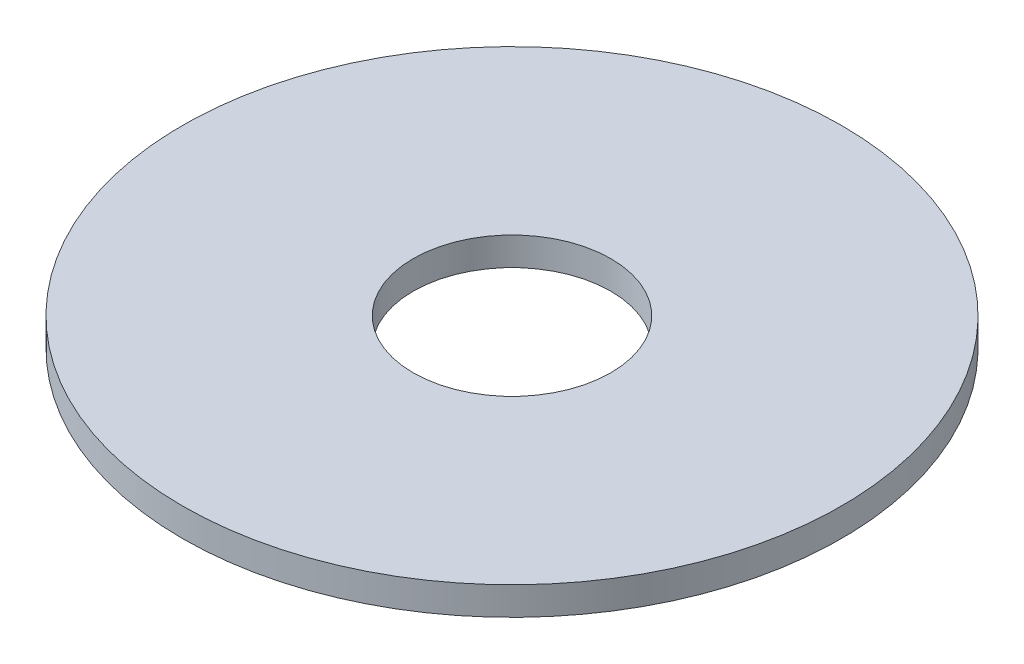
ISO-10303-21;
HEADER;
FILE_DESCRIPTION(('STEP AP214'),'2;1');
FILE_NAME('part.step','',(''),(''),'','','');
FILE_SCHEMA(('AUTOMOTIVE_DESIGN { 1 0 10303 214 1 1 1 1 }'));
ENDSEC;
DATA;
#1=APPLICATION_CONTEXT('core data for automotive mechanical design processes');
#2=APPLICATION_PROTOCOL_DEFINITION('international standard','automotive_design',2000,#1);
#3=PRODUCT_CONTEXT('',#1,'mechanical');
#4=PRODUCT('Part','Part','',(#3));
#5=PRODUCT_RELATED_PRODUCT_CATEGORY('part','',(#4));
#6=PRODUCT_DEFINITION_FORMATION('','',#4);
#7=PRODUCT_DEFINITION_CONTEXT('part definition',#1,'design');
#8=PRODUCT_DEFINITION('design','',#6,#7);
#9=PRODUCT_DEFINITION_SHAPE('','',#8);
#10=(LENGTH_UNIT() NAMED_UNIT(*) SI_UNIT(.MILLI.,.METRE.));
#11=(NAMED_UNIT(*) PLANE_ANGLE_UNIT() SI_UNIT($,.RADIAN.));
#12=(NAMED_UNIT(*) SI_UNIT($,.STERADIAN.) SOLID_ANGLE_UNIT());
#13=UNCERTAINTY_MEASURE_WITH_UNIT(LENGTH_MEASURE(1.E-05),#10,'distance_accuracy_value','');
#14=(GEOMETRIC_REPRESENTATION_CONTEXT(3) GLOBAL_UNCERTAINTY_ASSIGNED_CONTEXT((#13)) GLOBAL_UNIT_ASSIGNED_CONTEXT((#10,
#11,#12)) REPRESENTATION_CONTEXT('',''));
#15=CARTESIAN_POINT('',(0.,0.,0.));
#16=DIRECTION('',(0.,0.,1.));
#17=DIRECTION('',(1.,0.,0.));
#18=AXIS2_PLACEMENT_3D('',#15,#16,#17);
#19=CARTESIAN_POINT('',(0.,3.,0.));
#20=DIRECTION('',(0.,1.,0.));
#21=DIRECTION('',(0.,0.,1.));
#22=AXIS2_PLACEMENT_3D('',#19,#20,#21);
#23=PLANE('',#22);
#24=CARTESIAN_POINT('',(0.,3.,0.));
#25=DIRECTION('',(0.,1.,0.));
#26=DIRECTION('',(0.,0.,1.));
#27=AXIS2_PLACEMENT_3D('',#24,#25,#26);
#28=CIRCLE('',#27,35.);
#29=CARTESIAN_POINT('',(0.,3.,35.));
#30=VERTEX_POINT('',#29);
#31=EDGE_CURVE('E10',#30,#30,#28,.T.);
#32=ORIENTED_EDGE('',*,*,#31,.T.);
#33=EDGE_LOOP('',(#32));
#34=FACE_BOUND('',#33,.T.);
#35=CARTESIAN_POINT('',(0.,3.,0.));
#36=DIRECTION('',(0.,1.,0.));
#37=DIRECTION('',(0.,0.,1.));
#38=AXIS2_PLACEMENT_3D('',#35,#36,#37);
#39=CIRCLE('',#38,10.5);
#40=CARTESIAN_POINT('',(0.,3.,10.5));
#41=VERTEX_POINT('',#40);
#42=EDGE_CURVE('E41',#41,#41,#39,.T.);
#43=ORIENTED_EDGE('',*,*,#42,.F.);
#44=EDGE_LOOP('',(#43));
#45=FACE_BOUND('',#44,.T.);
#46=ADVANCED_FACE('F30',(#34,#45),#23,.T.);
#47=CARTESIAN_POINT('',(0.,0.,0.));
#48=DIRECTION('',(0.,1.,0.));
#49=DIRECTION('',(0.,0.,1.));
#50=AXIS2_PLACEMENT_3D('',#47,#48,#49);
#51=PLANE('',#50);
#52=CARTESIAN_POINT('',(0.,0.,0.));
#53=DIRECTION('',(0.,1.,0.));
#54=DIRECTION('',(0.,0.,1.));
#55=AXIS2_PLACEMENT_3D('',#52,#53,#54);
#56=CIRCLE('',#55,35.);
#57=CARTESIAN_POINT('',(0.,0.,35.));
#58=VERTEX_POINT('',#57);
#59=EDGE_CURVE('E37',#58,#58,#56,.T.);
#60=ORIENTED_EDGE('',*,*,#59,.F.);
#61=EDGE_LOOP('',(#60));
#62=FACE_BOUND('',#61,.T.);
#63=CARTESIAN_POINT('',(0.,0.,0.));
#64=DIRECTION('',(0.,1.,0.));
#65=DIRECTION('',(0.,0.,1.));
#66=AXIS2_PLACEMENT_3D('',#63,#64,#65);
#67=CIRCLE('',#66,10.5);
#68=CARTESIAN_POINT('',(0.,0.,10.5));
#69=VERTEX_POINT('',#68);
#70=EDGE_CURVE('E45',#69,#69,#67,.T.);
#71=ORIENTED_EDGE('',*,*,#70,.T.);
#72=EDGE_LOOP('',(#71));
#73=FACE_BOUND('',#72,.T.);
#74=ADVANCED_FACE('F51',(#62,#73),#51,.F.);
#75=CARTESIAN_POINT('',(0.,3.,0.));
#76=DIRECTION('',(0.,-1.,0.));
#77=DIRECTION('',(0.,0.,-1.));
#78=AXIS2_PLACEMENT_3D('',#75,#76,#77);
#79=CYLINDRICAL_SURFACE('',#78,35.);
#80=ORIENTED_EDGE('',*,*,#31,.F.);
#81=EDGE_LOOP('',(#80));
#82=FACE_BOUND('',#81,.T.);
#83=ORIENTED_EDGE('',*,*,#59,.T.);
#84=EDGE_LOOP('',(#83));
#85=FACE_BOUND('',#84,.T.);
#86=ADVANCED_FACE('F32',(#82,#85),#79,.T.);
#87=CARTESIAN_POINT('',(0.,3.,0.));
#88=DIRECTION('',(0.,-1.,0.));
#89=DIRECTION('',(0.,0.,-1.));
#90=AXIS2_PLACEMENT_3D('',#87,#88,#89);
#91=CYLINDRICAL_SURFACE('',#90,10.5);
#92=ORIENTED_EDGE('',*,*,#42,.T.);
#93=EDGE_LOOP('',(#92));
#94=FACE_BOUND('',#93,.T.);
#95=ORIENTED_EDGE('',*,*,#70,.F.);
#96=EDGE_LOOP('',(#95));
#97=FACE_BOUND('',#96,.T.);
#98=ADVANCED_FACE('F53',(#94,#97),#91,.F.);
#99=CLOSED_SHELL('',(#46,#74,#86,#98));
#100=MANIFOLD_SOLID_BREP('B2',#99);
#101=ADVANCED_BREP_SHAPE_REPRESENTATION('',(#18,#100),#14);
#102=SHAPE_DEFINITION_REPRESENTATION(#9,#101);
ENDSEC;
END-ISO-10303-21;
